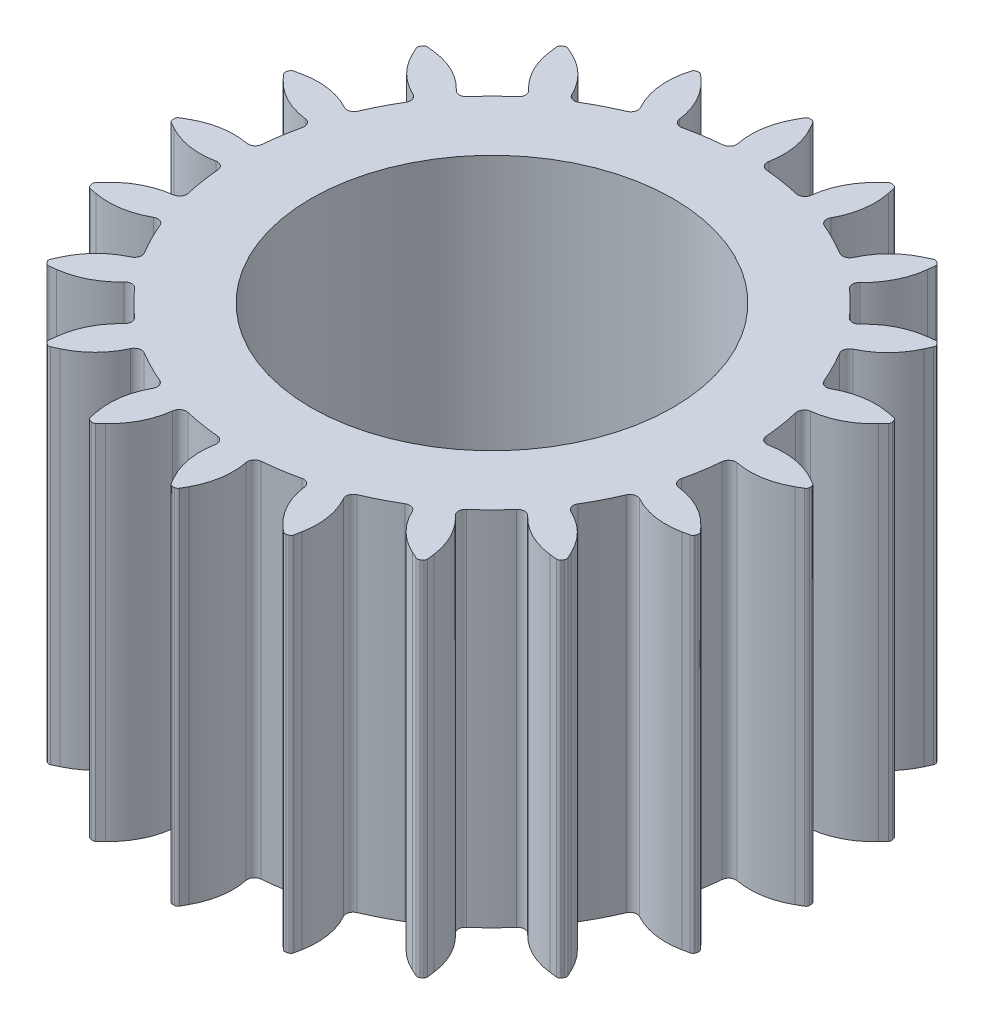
from build123d import *

# Parameters (mm, degrees)
BOSS_EXTRUDE1_DEPTH = 50
SKETCH2_R           = 25
CUT_EXTRUDE1_DEPTH  = 84.482500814


with BuildPart() as part:
    # Sketch1 → Boss-Extrude1 (new body)
    with BuildSketch(Plane(origin=(0, 0, 0), x_dir=(1, 0, 0), z_dir=(0, 1, 0))):
        with BuildLine():
            ThreePointArc((-4.862786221, -39.908293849), (-4.911604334, -43.438218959), (-3.730790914, -46.76514459))
            Line((-3.730790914, -46.76514459), (-3.251528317, -47.60511437))
            ThreePointArc((-3.251528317, -47.60511437), (-3.069031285, -47.789302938), (-2.818823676, -47.85732314))
            Line((-2.818823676, -47.85732314), (-2.541245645, -47.855587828))
            ThreePointArc((-2.541245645, -47.855587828), (-2.291908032, -47.784444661), (-2.111728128, -47.597988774))
            Line((-2.111728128, -47.597988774), (-1.643004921, -46.75209255))
            ThreePointArc((-1.643004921, -46.75209255), (-0.507182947, -43.432200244), (-0.58810198, -39.924319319))
            ThreePointArc((-0.58810198, -39.924319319), (-0.408238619, -39.126646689), (0.306743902, -38.72986911))
            ThreePointArc((0.306743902, -38.72986911), (2.750636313, -38.433659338), (5.167662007, -37.966393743))
            ThreePointArc((5.167662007, -37.966393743), (5.965472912, -38.121790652), (6.384340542, -38.818353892))
            ThreePointArc((6.384340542, -38.818353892), (7.428718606, -42.190597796), (9.579815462, -44.989800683))
            Line((9.579815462, -44.989800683), (10.295186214, -45.640559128))
            ThreePointArc((10.295186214, -45.640559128), (10.525668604, -45.759338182), (10.784649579, -45.746710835))
            Line((10.784649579, -45.746710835), (11.048105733, -45.659284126))
            ThreePointArc((11.048105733, -45.659284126), (11.263255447, -45.514573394), (11.376998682, -45.281564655))
            Line((11.376998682, -45.281564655), (11.561384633, -44.332226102))
            ThreePointArc((11.561384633, -44.332226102), (11.615712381, -40.823832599), (10.454758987, -37.512644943))
            ThreePointArc((10.454758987, -37.512644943), (10.37932481, -36.698432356), (10.93670258, -36.100132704))
            ThreePointArc((10.93670258, -36.100132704), (13.16944853, -35.063216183), (15.323783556, -33.871918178))
            ThreePointArc((15.323783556, -33.871918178), (16.130567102, -33.773172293), (16.74418377, -34.306206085))
            ThreePointArc((16.74418377, -34.306206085), (18.779527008, -37.190670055), (21.690342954, -39.188144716))
            Line((21.690342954, -39.188144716), (22.571796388, -39.585991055))
            ThreePointArc((22.571796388, -39.585991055), (22.827702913, -39.627733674), (23.070106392, -39.53569483))
            Line((23.070106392, -39.53569483), (23.293651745, -39.37113466))
            ThreePointArc((23.293651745, -39.37113466), (23.453553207, -39.167021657), (23.489725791, -38.910268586))
            Line((23.489725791, -38.910268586), (23.371725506, -37.950415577))
            ThreePointArc((23.371725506, -37.950415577), (22.339241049, -34.596946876), (20.211895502, -31.806574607))
            ThreePointArc((20.211895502, -31.806574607), (19.888547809, -31.055522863), (20.233760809, -30.314266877))
            ThreePointArc((20.233760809, -30.314266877), (22.036803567, -28.638144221), (23.717566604, -26.839426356))
            ThreePointArc((23.717566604, -26.839426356), (24.454349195, -26.496203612), (25.202649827, -26.813530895))
            ThreePointArc((25.202649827, -26.813530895), (28.029724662, -28.927863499), (31.415328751, -29.928083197))
            Line((31.415328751, -29.928083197), (32.376582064, -30.03407346))
            ThreePointArc((32.376582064, -30.03407346), (32.63286281, -29.994693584), (32.834960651, -29.832252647))
            Line((32.834960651, -29.832252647), (32.996713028, -29.606667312))
            ThreePointArc((32.996713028, -29.606667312), (33.085713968, -29.363132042), (33.040775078, -29.107767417))
            Line((33.040775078, -29.107767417), (32.631939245, -28.231357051))
            ThreePointArc((32.631939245, -28.231357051), (30.613709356, -25.361074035), (27.728211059, -23.364658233))
            ThreePointArc((27.728211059, -23.364658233), (27.188601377, -22.75028551), (27.287857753, -21.93863249))
            ThreePointArc((27.287857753, -21.93863249), (28.484702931, -19.787374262), (29.527369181, -17.557307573))
            ThreePointArc((29.527369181, -17.557307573), (30.122029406, -17.003205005), (30.93176512, -17.073763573))
            ThreePointArc((30.93176512, -17.073763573), (34.273837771, -18.210999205), (37.802823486, -18.116055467))
            Line((37.802823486, -18.116055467), (38.749782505, -17.919814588))
            ThreePointArc((38.749782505, -17.919814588), (38.981350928, -17.803166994), (39.123360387, -17.586224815))
            Line((39.123360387, -17.586224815), (39.207486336, -17.321696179))
            ThreePointArc((39.207486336, -17.321696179), (39.216874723, -17.06257757), (39.09522329, -16.83359826))
            Line((39.09522329, -16.83359826), (38.43557161, -16.126419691))
            ThreePointArc((38.43557161, -16.126419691), (35.629154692, -14.020285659), (32.267956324, -13.013249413))
            ThreePointArc((32.267956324, -13.013249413), (31.564905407, -12.595694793), (31.408489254, -11.793094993))
            ThreePointArc((31.408489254, -11.793094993), (31.881981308, -9.377281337), (32.184487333, -6.93416029))
            ThreePointArc((32.184487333, -6.93416029), (32.578815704, -6.223417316), (33.370723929, -6.040300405))
            ThreePointArc((33.370723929, -6.040300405), (36.900649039, -6.089118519), (40.22757467, -4.908305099))
            Line((40.22757467, -4.908305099), (41.067544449, -4.429042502))
            ThreePointArc((41.067544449, -4.429042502), (41.251733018, -4.24654547), (41.319753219, -3.996337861))
            Line((41.319753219, -3.996337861), (41.318017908, -3.71875983))
            ThreePointArc((41.318017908, -3.71875983), (41.24687474, -3.469422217), (41.060418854, -3.289242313))
            Line((41.060418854, -3.289242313), (40.214522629, -2.820519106))
            ThreePointArc((40.214522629, -2.820519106), (36.894630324, -1.684697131), (33.386749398, -1.765616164))
            ThreePointArc((33.386749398, -1.765616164), (32.589076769, -1.585752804), (32.19229919, -0.870770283))
            ThreePointArc((32.19229919, -0.870770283), (31.896089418, 1.573122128), (31.428823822, 3.990147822))
            ThreePointArc((31.428823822, 3.990147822), (31.584220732, 4.787958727), (32.280783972, 5.206826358))
            ThreePointArc((32.280783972, 5.206826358), (35.653027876, 6.251204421), (38.452230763, 8.402301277))
            Line((38.452230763, 8.402301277), (39.102989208, 9.11767203))
            ThreePointArc((39.102989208, 9.11767203), (39.221768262, 9.348154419), (39.209140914, 9.607135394))
            Line((39.209140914, 9.607135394), (39.121714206, 9.870591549))
            ThreePointArc((39.121714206, 9.870591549), (38.977003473, 10.085741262), (38.743994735, 10.199484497))
            Line((38.743994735, 10.199484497), (37.794656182, 10.383870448))
            ThreePointArc((37.794656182, 10.383870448), (34.286262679, 10.438198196), (30.975075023, 9.277244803))
            ThreePointArc((30.975075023, 9.277244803), (30.160862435, 9.201810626), (29.562562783, 9.759188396))
            ThreePointArc((29.562562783, 9.759188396), (28.525646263, 11.991934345), (27.334348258, 14.146269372))
            ThreePointArc((27.334348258, 14.146269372), (27.235602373, 14.953052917), (27.768636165, 15.566669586))
            ThreePointArc((27.768636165, 15.566669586), (30.653100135, 17.602012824), (32.650574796, 20.512828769))
            Line((32.650574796, 20.512828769), (33.048421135, 21.394282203))
            ThreePointArc((33.048421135, 21.394282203), (33.090163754, 21.650188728), (32.99812491, 21.892592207))
            Line((32.99812491, 21.892592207), (32.83356474, 22.116137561))
            ThreePointArc((32.83356474, 22.116137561), (32.629451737, 22.276039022), (32.372698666, 22.312211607))
            Line((32.372698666, 22.312211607), (31.412845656, 22.194211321))
            ThreePointArc((31.412845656, 22.194211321), (28.059376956, 21.161726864), (25.269004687, 19.034381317))
            ThreePointArc((25.269004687, 19.034381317), (24.517952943, 18.711033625), (23.776696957, 19.056246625))
            ThreePointArc((23.776696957, 19.056246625), (22.100574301, 20.859289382), (20.301856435, 22.540052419))
            ThreePointArc((20.301856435, 22.540052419), (19.958633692, 23.276835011), (20.275960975, 24.025135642))
            ThreePointArc((20.275960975, 24.025135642), (22.390293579, 26.852210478), (23.390513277, 30.237814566))
            Line((23.390513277, 30.237814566), (23.49650354, 31.199067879))
            ThreePointArc((23.49650354, 31.199067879), (23.457123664, 31.455348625), (23.294682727, 31.657446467))
            Line((23.294682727, 31.657446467), (23.069097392, 31.819198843))
            ThreePointArc((23.069097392, 31.819198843), (22.825562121, 31.908199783), (22.570197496, 31.863260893))
            Line((22.570197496, 31.863260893), (21.693787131, 31.45442506))
            ThreePointArc((21.693787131, 31.45442506), (18.823504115, 29.436195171), (16.827088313, 26.550696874))
            ThreePointArc((16.827088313, 26.550696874), (16.212715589, 26.011087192), (15.40106257, 26.110343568))
            ThreePointArc((15.40106257, 26.110343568), (13.249804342, 27.307188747), (11.019737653, 28.349854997))
            ThreePointArc((11.019737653, 28.349854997), (10.465635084, 28.944515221), (10.536193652, 29.754250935))
            ThreePointArc((10.536193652, 29.754250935), (11.673429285, 33.096323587), (11.578485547, 36.625309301))
            Line((11.578485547, 36.625309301), (11.382244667, 37.572268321))
            ThreePointArc((11.382244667, 37.572268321), (11.265597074, 37.803836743), (11.048654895, 37.945846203))
            Line((11.048654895, 37.945846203), (10.784126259, 38.029972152))
            ThreePointArc((10.784126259, 38.029972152), (10.52500765, 38.039360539), (10.29602834, 37.917709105))
            Line((10.29602834, 37.917709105), (9.588849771, 37.258057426))
            ThreePointArc((9.588849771, 37.258057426), (7.482715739, 34.451640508), (6.475679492, 31.090442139))
            ThreePointArc((6.475679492, 31.090442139), (6.058124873, 30.387391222), (5.255525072, 30.230975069))
            ThreePointArc((5.255525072, 30.230975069), (2.839711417, 30.704467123), (0.39659037, 31.006973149))
            ThreePointArc((0.39659037, 31.006973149), (-0.314152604, 31.40130152), (-0.497269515, 32.193209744))
            ThreePointArc((-0.497269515, 32.193209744), (-0.448451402, 35.723134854), (-1.629264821, 39.050060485))
            Line((-1.629264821, 39.050060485), (-2.108527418, 39.890030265))
            ThreePointArc((-2.108527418, 39.890030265), (-2.29102445, 40.074218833), (-2.541232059, 40.142239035))
            Line((-2.541232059, 40.142239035), (-2.81881009, 40.140503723))
            ThreePointArc((-2.81881009, 40.140503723), (-3.068147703, 40.069360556), (-3.248327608, 39.882904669))
            Line((-3.248327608, 39.882904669), (-3.717050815, 39.037008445))
            ThreePointArc((-3.717050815, 39.037008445), (-4.852872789, 35.717116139), (-4.771953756, 32.209235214))
            ThreePointArc((-4.771953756, 32.209235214), (-4.951817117, 31.411562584), (-5.666799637, 31.014785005))
            ThreePointArc((-5.666799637, 31.014785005), (-8.110692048, 30.718575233), (-10.527717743, 30.251309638))
            ThreePointArc((-10.527717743, 30.251309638), (-11.325528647, 30.406706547), (-11.744396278, 31.103269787))
            ThreePointArc((-11.744396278, 31.103269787), (-12.788774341, 34.475513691), (-14.939871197, 37.274716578))
            Line((-14.939871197, 37.274716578), (-15.65524195, 37.925475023))
            ThreePointArc((-15.65524195, 37.925475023), (-15.885724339, 38.044254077), (-16.144705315, 38.03162673))
            Line((-16.144705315, 38.03162673), (-16.408161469, 37.944200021))
            ThreePointArc((-16.408161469, 37.944200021), (-16.517993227, 37.890843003), (-16.61161684, 37.812455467))
            ThreePointArc((-16.61161684, 37.812455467), (-16.784996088, 37.219585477), (-16.921440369, 36.617141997))
            ThreePointArc((-16.921440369, 36.617141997), (-16.975768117, 33.108748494), (-15.814814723, 29.797560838))
            ThreePointArc((-15.814814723, 29.797560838), (-15.739380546, 28.983348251), (-16.296758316, 28.385048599))
            ThreePointArc((-16.296758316, 28.385048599), (-18.529504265, 27.348132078), (-20.683839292, 26.156834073))
            ThreePointArc((-20.683839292, 26.156834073), (-21.490622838, 26.058088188), (-22.104239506, 26.59112198))
            ThreePointArc((-22.104239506, 26.59112198), (-24.139582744, 29.47558595), (-27.050398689, 31.473060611))
            Line((-27.050398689, 31.473060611), (-27.931852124, 31.87090695))
            ThreePointArc((-27.931852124, 31.87090695), (-28.187758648, 31.912649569), (-28.430162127, 31.820610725))
            Line((-28.430162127, 31.820610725), (-28.653707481, 31.656050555))
            ThreePointArc((-28.653707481, 31.656050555), (-28.813608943, 31.451937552), (-28.849781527, 31.195184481))
            Line((-28.849781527, 31.195184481), (-28.731781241, 30.235331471))
            ThreePointArc((-28.731781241, 30.235331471), (-27.699296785, 26.881862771), (-25.571951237, 24.091490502))
            ThreePointArc((-25.571951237, 24.091490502), (-25.248603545, 23.340438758), (-25.593816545, 22.599182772))
            ThreePointArc((-25.593816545, 22.599182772), (-27.396859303, 20.923060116), (-29.077622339, 19.124342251))
            ThreePointArc((-29.077622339, 19.124342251), (-29.814404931, 18.781119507), (-30.562705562, 19.09844679))
            ThreePointArc((-30.562705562, 19.09844679), (-33.389780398, 21.212779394), (-36.775384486, 22.212999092))
            Line((-36.775384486, 22.212999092), (-37.736637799, 22.318989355))
            ThreePointArc((-37.736637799, 22.318989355), (-37.992918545, 22.279609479), (-38.195016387, 22.117168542))
            Line((-38.195016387, 22.117168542), (-38.356768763, 21.891583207))
            ThreePointArc((-38.356768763, 21.891583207), (-38.445769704, 21.648047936), (-38.400830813, 21.392683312))
            Line((-38.400830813, 21.392683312), (-37.991994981, 20.516272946))
            ThreePointArc((-37.991994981, 20.516272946), (-35.973765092, 17.64598993), (-33.088266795, 15.649574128))
            ThreePointArc((-33.088266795, 15.649574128), (-32.548657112, 15.035201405), (-32.647913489, 14.223548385))
            ThreePointArc((-32.647913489, 14.223548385), (-33.844758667, 12.072290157), (-34.887424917, 9.842223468))
            ThreePointArc((-34.887424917, 9.842223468), (-35.482085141, 9.288120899), (-36.291820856, 9.358679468))
            ThreePointArc((-36.291820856, 9.358679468), (-39.633893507, 10.4959151), (-43.162879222, 10.400971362))
            Line((-43.162879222, 10.400971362), (-44.109838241, 10.204730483))
            ThreePointArc((-44.109838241, 10.204730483), (-44.341406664, 10.088082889), (-44.483416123, 9.87114071))
            Line((-44.483416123, 9.87114071), (-44.567542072, 9.606612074))
            ThreePointArc((-44.567542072, 9.606612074), (-44.576930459, 9.347493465), (-44.455279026, 9.118514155))
            Line((-44.455279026, 9.118514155), (-43.795627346, 8.411335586))
            ThreePointArc((-43.795627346, 8.411335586), (-40.989210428, 6.305201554), (-37.628012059, 5.298165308))
            ThreePointArc((-37.628012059, 5.298165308), (-36.924961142, 4.880610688), (-36.768544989, 4.078010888))
            ThreePointArc((-36.768544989, 4.078010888), (-37.242037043, 1.662197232), (-37.544543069, -0.780923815))
            ThreePointArc((-37.544543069, -0.780923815), (-37.93887144, -1.491666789), (-38.730779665, -1.6747837))
            ThreePointArc((-38.730779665, -1.6747837), (-42.260704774, -1.625965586), (-45.587630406, -2.806779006))
            Line((-45.587630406, -2.806779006), (-46.427600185, -3.286041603))
            ThreePointArc((-46.427600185, -3.286041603), (-46.611788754, -3.468538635), (-46.679808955, -3.718746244))
            Line((-46.679808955, -3.718746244), (-46.678073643, -3.996324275))
            ThreePointArc((-46.678073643, -3.996324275), (-46.606930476, -4.245661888), (-46.420474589, -4.425841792))
            Line((-46.420474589, -4.425841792), (-45.574578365, -4.894564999))
            ThreePointArc((-45.574578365, -4.894564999), (-42.25468606, -6.030386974), (-38.746805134, -5.949467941))
            ThreePointArc((-38.746805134, -5.949467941), (-37.949132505, -6.129331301), (-37.552354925, -6.844313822))
            ThreePointArc((-37.552354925, -6.844313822), (-37.256145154, -9.288206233), (-36.788879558, -11.705231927))
            ThreePointArc((-36.788879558, -11.705231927), (-36.944276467, -12.503042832), (-37.640839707, -12.921910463))
            ThreePointArc((-37.640839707, -12.921910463), (-41.013083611, -13.966288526), (-43.812286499, -16.117385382))
            Line((-43.812286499, -16.117385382), (-44.463044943, -16.832756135))
            ThreePointArc((-44.463044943, -16.832756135), (-44.581823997, -17.063238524), (-44.56919665, -17.322219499))
            Line((-44.56919665, -17.322219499), (-44.481769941, -17.585675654))
            ThreePointArc((-44.481769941, -17.585675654), (-44.337059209, -17.800825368), (-44.10405047, -17.914568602))
            Line((-44.10405047, -17.914568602), (-43.154711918, -18.098954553))
            ThreePointArc((-43.154711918, -18.098954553), (-39.646318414, -18.153282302), (-36.335130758, -16.992328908))
            ThreePointArc((-36.335130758, -16.992328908), (-35.520918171, -16.916894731), (-34.922618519, -17.474272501))
            ThreePointArc((-34.922618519, -17.474272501), (-33.885701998, -19.70701845), (-32.694403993, -21.861353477))
            ThreePointArc((-32.694403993, -21.861353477), (-32.595658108, -22.668137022), (-33.128691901, -23.281753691))
            ThreePointArc((-33.128691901, -23.281753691), (-36.01315587, -25.317096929), (-38.010630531, -28.227912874))
            Line((-38.010630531, -28.227912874), (-38.408476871, -29.109366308))
            ThreePointArc((-38.408476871, -29.109366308), (-38.450219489, -29.365272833), (-38.358180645, -29.607676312))
            Line((-38.358180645, -29.607676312), (-38.193620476, -29.831221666))
            ThreePointArc((-38.193620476, -29.831221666), (-37.989507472, -29.991123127), (-37.732754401, -30.027295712))
            Line((-37.732754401, -30.027295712), (-36.772901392, -29.909295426))
            ThreePointArc((-36.772901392, -29.909295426), (-33.419432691, -28.87681097), (-30.629060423, -26.749465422))
            ThreePointArc((-30.629060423, -26.749465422), (-29.878008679, -26.42611773), (-29.136752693, -26.77133073))
            ThreePointArc((-29.136752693, -26.77133073), (-27.460630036, -28.574373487), (-25.661912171, -30.255136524))
            ThreePointArc((-25.661912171, -30.255136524), (-25.318689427, -30.991919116), (-25.63601671, -31.740219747))
            ThreePointArc((-25.63601671, -31.740219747), (-27.750349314, -34.567294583), (-28.750569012, -37.952898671))
            Line((-28.750569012, -37.952898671), (-28.856559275, -38.914151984))
            ThreePointArc((-28.856559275, -38.914151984), (-28.817179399, -39.17043273), (-28.654738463, -39.372530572))
            Line((-28.654738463, -39.372530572), (-28.429153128, -39.534282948))
            ThreePointArc((-28.429153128, -39.534282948), (-28.185617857, -39.623283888), (-27.930253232, -39.578344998))
            Line((-27.930253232, -39.578344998), (-27.053842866, -39.169509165))
            ThreePointArc((-27.053842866, -39.169509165), (-24.18355985, -37.151279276), (-22.187144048, -34.265780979))
            ThreePointArc((-22.187144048, -34.265780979), (-21.572771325, -33.726171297), (-20.761118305, -33.825427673))
            ThreePointArc((-20.761118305, -33.825427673), (-18.609860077, -35.022272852), (-16.379793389, -36.064939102))
            ThreePointArc((-16.379793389, -36.064939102), (-15.82569082, -36.659599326), (-15.896249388, -37.46933504))
            ThreePointArc((-15.896249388, -37.46933504), (-17.03348502, -40.811407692), (-16.938541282, -44.340393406))
            Line((-16.938541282, -44.340393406), (-16.742300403, -45.287352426))
            ThreePointArc((-16.742300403, -45.287352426), (-16.625652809, -45.518920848), (-16.40871063, -45.660930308))
            Line((-16.40871063, -45.660930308), (-16.144181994, -45.745056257))
            ThreePointArc((-16.144181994, -45.745056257), (-15.885063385, -45.754444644), (-15.656084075, -45.63279321))
            Line((-15.656084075, -45.63279321), (-14.948905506, -44.973141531))
            ThreePointArc((-14.948905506, -44.973141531), (-12.842771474, -42.166724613), (-11.835735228, -38.805526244))
            ThreePointArc((-11.835735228, -38.805526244), (-11.418180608, -38.102475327), (-10.615580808, -37.946059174))
            ThreePointArc((-10.615580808, -37.946059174), (-8.199767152, -38.419551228), (-5.756646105, -38.722057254))
            ThreePointArc((-5.756646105, -38.722057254), (-5.045903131, -39.116385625), (-4.862786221, -39.908293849))
        make_face()
    extrude(amount=BOSS_EXTRUDE1_DEPTH)

    # Sketch2 → Cut-Extrude1 (cut, through all)
    with BuildSketch(Plane(origin=(0, 50, 0), x_dir=(1, 0, 0), z_dir=(0, 1, 0))):
        with Locations(Location((-2.680027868, -3.857542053, 0), (0, 0, 270))):
            Circle(SKETCH2_R)
    extrude(amount=-CUT_EXTRUDE1_DEPTH, mode=Mode.SUBTRACT)


solid = part.part
